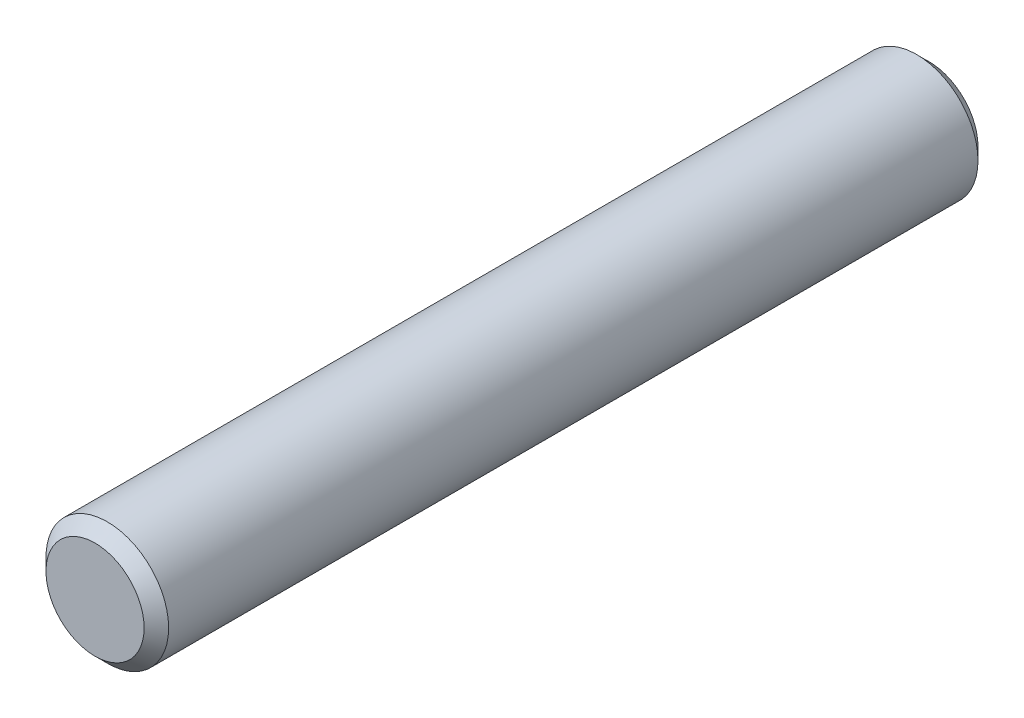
ISO-10303-21;
HEADER;
FILE_DESCRIPTION(('STEP AP214'),'2;1');
FILE_NAME('part.step','',(''),(''),'','','');
FILE_SCHEMA(('AUTOMOTIVE_DESIGN { 1 0 10303 214 1 1 1 1 }'));
ENDSEC;
DATA;
#1=APPLICATION_CONTEXT('core data for automotive mechanical design processes');
#2=APPLICATION_PROTOCOL_DEFINITION('international standard','automotive_design',2000,#1);
#3=PRODUCT_CONTEXT('',#1,'mechanical');
#4=PRODUCT('Part','Part','',(#3));
#5=PRODUCT_RELATED_PRODUCT_CATEGORY('part','',(#4));
#6=PRODUCT_DEFINITION_FORMATION('','',#4);
#7=PRODUCT_DEFINITION_CONTEXT('part definition',#1,'design');
#8=PRODUCT_DEFINITION('design','',#6,#7);
#9=PRODUCT_DEFINITION_SHAPE('','',#8);
#10=(LENGTH_UNIT() NAMED_UNIT(*) SI_UNIT(.MILLI.,.METRE.));
#11=(NAMED_UNIT(*) PLANE_ANGLE_UNIT() SI_UNIT($,.RADIAN.));
#12=(NAMED_UNIT(*) SI_UNIT($,.STERADIAN.) SOLID_ANGLE_UNIT());
#13=UNCERTAINTY_MEASURE_WITH_UNIT(LENGTH_MEASURE(1.E-05),#10,'distance_accuracy_value','');
#14=(GEOMETRIC_REPRESENTATION_CONTEXT(3) GLOBAL_UNCERTAINTY_ASSIGNED_CONTEXT((#13)) GLOBAL_UNIT_ASSIGNED_CONTEXT((#10,
#11,#12)) REPRESENTATION_CONTEXT('',''));
#15=CARTESIAN_POINT('',(0.,0.,0.));
#16=DIRECTION('',(0.,0.,1.));
#17=DIRECTION('',(1.,0.,0.));
#18=AXIS2_PLACEMENT_3D('',#15,#16,#17);
#19=CARTESIAN_POINT('',(0.,0.,68.));
#20=DIRECTION('',(0.,0.,-1.));
#21=DIRECTION('',(-1.,0.,0.));
#22=AXIS2_PLACEMENT_3D('',#19,#20,#21);
#23=CYLINDRICAL_SURFACE('',#22,5.);
#24=CARTESIAN_POINT('',(0.,0.,67.));
#25=DIRECTION('',(0.,0.,1.));
#26=DIRECTION('',(1.,0.,0.));
#27=AXIS2_PLACEMENT_3D('',#24,#25,#26);
#28=CIRCLE('',#27,5.);
#29=CARTESIAN_POINT('',(5.,0.,67.));
#30=VERTEX_POINT('',#29);
#31=EDGE_CURVE('E10',#30,#30,#28,.F.);
#32=ORIENTED_EDGE('',*,*,#31,.T.);
#33=EDGE_LOOP('',(#32));
#34=FACE_BOUND('',#33,.T.);
#35=CARTESIAN_POINT('',(0.,0.,1.));
#36=DIRECTION('',(0.,0.,1.));
#37=DIRECTION('',(1.,0.,0.));
#38=AXIS2_PLACEMENT_3D('',#35,#36,#37);
#39=CIRCLE('',#38,5.);
#40=CARTESIAN_POINT('',(5.,0.,1.));
#41=VERTEX_POINT('',#40);
#42=EDGE_CURVE('E58',#41,#41,#39,.T.);
#43=ORIENTED_EDGE('',*,*,#42,.T.);
#44=EDGE_LOOP('',(#43));
#45=FACE_BOUND('',#44,.T.);
#46=ADVANCED_FACE('F39',(#34,#45),#23,.T.);
#47=CARTESIAN_POINT('',(0.,0.,68.));
#48=DIRECTION('',(0.,0.,1.));
#49=DIRECTION('',(1.,0.,0.));
#50=AXIS2_PLACEMENT_3D('',#47,#48,#49);
#51=PLANE('',#50);
#52=CARTESIAN_POINT('',(0.,0.,68.));
#53=DIRECTION('',(0.,0.,1.));
#54=DIRECTION('',(1.,0.,0.));
#55=AXIS2_PLACEMENT_3D('',#52,#53,#54);
#56=CIRCLE('',#55,3.99999999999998);
#57=CARTESIAN_POINT('',(3.99999999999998,0.,68.));
#58=VERTEX_POINT('',#57);
#59=EDGE_CURVE('E48',#58,#58,#56,.T.);
#60=ORIENTED_EDGE('',*,*,#59,.T.);
#61=EDGE_LOOP('',(#60));
#62=FACE_BOUND('',#61,.T.);
#63=ADVANCED_FACE('F75',(#62),#51,.T.);
#64=CARTESIAN_POINT('',(0.,0.,0.));
#65=DIRECTION('',(0.,0.,1.));
#66=DIRECTION('',(1.,0.,0.));
#67=AXIS2_PLACEMENT_3D('',#64,#65,#66);
#68=PLANE('',#67);
#69=CARTESIAN_POINT('',(0.,0.,0.));
#70=DIRECTION('',(0.,0.,1.));
#71=DIRECTION('',(1.,0.,0.));
#72=AXIS2_PLACEMENT_3D('',#69,#70,#71);
#73=CIRCLE('',#72,3.99999999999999);
#74=CARTESIAN_POINT('',(3.99999999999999,0.,0.));
#75=VERTEX_POINT('',#74);
#76=EDGE_CURVE('E53',#75,#75,#73,.F.);
#77=ORIENTED_EDGE('',*,*,#76,.T.);
#78=EDGE_LOOP('',(#77));
#79=FACE_BOUND('',#78,.T.);
#80=ADVANCED_FACE('F68',(#79),#68,.F.);
#81=CARTESIAN_POINT('',(0.,0.,1.));
#82=DIRECTION('',(0.,0.,1.));
#83=DIRECTION('',(1.,0.,0.));
#84=AXIS2_PLACEMENT_3D('',#81,#82,#83);
#85=CONICAL_SURFACE('',#84,5.,0.785398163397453);
#86=ORIENTED_EDGE('',*,*,#76,.F.);
#87=EDGE_LOOP('',(#86));
#88=FACE_BOUND('',#87,.T.);
#89=ORIENTED_EDGE('',*,*,#42,.F.);
#90=EDGE_LOOP('',(#89));
#91=FACE_BOUND('',#90,.T.);
#92=ADVANCED_FACE('F66',(#88,#91),#85,.T.);
#93=CARTESIAN_POINT('',(0.,0.,68.));
#94=DIRECTION('',(0.,0.,-1.));
#95=DIRECTION('',(-1.,0.,0.));
#96=AXIS2_PLACEMENT_3D('',#93,#94,#95);
#97=CONICAL_SURFACE('',#96,3.99999999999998,0.78539816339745);
#98=ORIENTED_EDGE('',*,*,#31,.F.);
#99=EDGE_LOOP('',(#98));
#100=FACE_BOUND('',#99,.T.);
#101=ORIENTED_EDGE('',*,*,#59,.F.);
#102=EDGE_LOOP('',(#101));
#103=FACE_BOUND('',#102,.T.);
#104=ADVANCED_FACE('F42',(#100,#103),#97,.T.);
#105=CLOSED_SHELL('',(#46,#63,#80,#92,#104));
#106=MANIFOLD_SOLID_BREP('B2',#105);
#107=ADVANCED_BREP_SHAPE_REPRESENTATION('',(#18,#106),#14);
#108=SHAPE_DEFINITION_REPRESENTATION(#9,#107);
ENDSEC;
END-ISO-10303-21;
